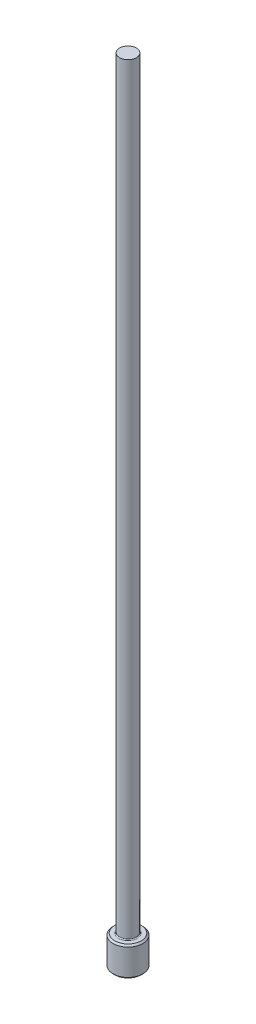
from build123d import *

# Parameters (mm, degrees)
CHAMFER1_SIZE = 0.127
FILLET1_R     = 0.0762


with BuildPart() as part:
    # Sketch1 → Revolve1 (revolve)
    with BuildSketch(Plane.XY, mode=Mode.PRIVATE) as revolve1_sk:
        Polygon((0, 0), (-1.1938, 0), (-1.1938, 2.3622), (-0.6731, 2.3622), (-0.6731, 63.5), (0, 63.5), align=None)
    revolve(revolve1_sk.sketch.rotate(Axis((0, 259.958771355, 0), (0, -1, 0)), 270), axis=Axis((0, 259.958771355, 0), (0, -1, 0)))

    # Chamfer1
    chamfer1_edges = [part.edges().sort_by_distance(p)[0] for p in [
        (0, 2.3622, -1.1938),
        (0, 0, -1.1938),
    ]]
    chamfer(chamfer1_edges, length=CHAMFER1_SIZE)

    # Fillet1
    fillet1_edges = [part.edges().sort_by_distance(p)[0] for p in [
        (0, 2.3622, -0.6731),
    ]]
    fillet(fillet1_edges, radius=FILLET1_R)


solid = part.part
